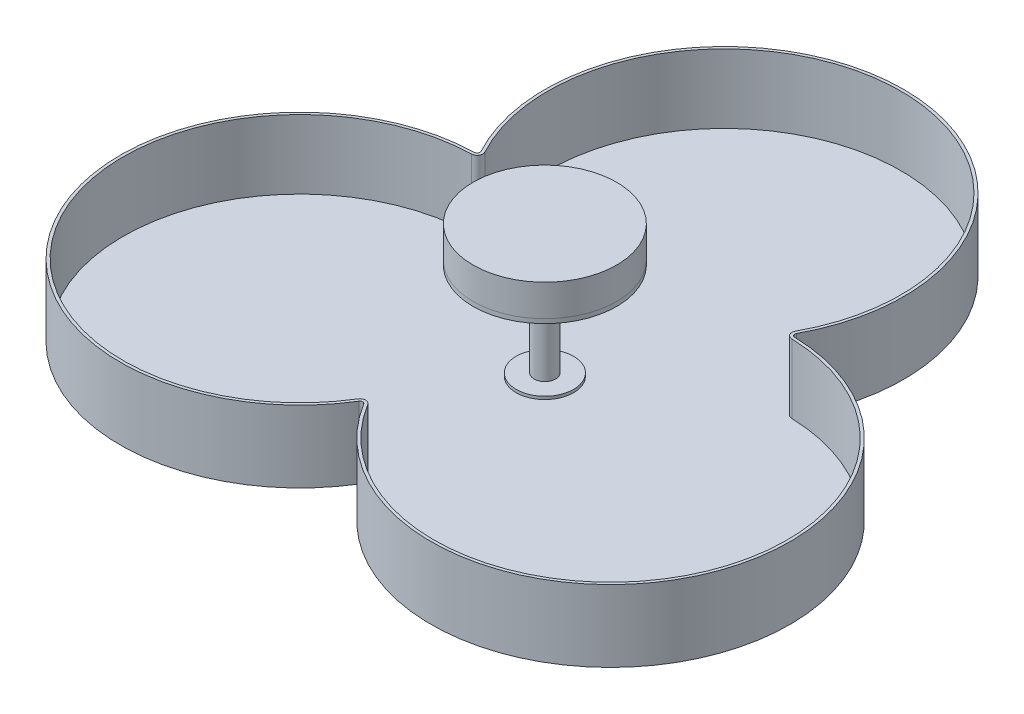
ISO-10303-21;
HEADER;
FILE_DESCRIPTION(('STEP AP214'),'2;1');
FILE_NAME('part.step','',(''),(''),'','','');
FILE_SCHEMA(('AUTOMOTIVE_DESIGN { 1 0 10303 214 1 1 1 1 }'));
ENDSEC;
DATA;
#1=APPLICATION_CONTEXT('core data for automotive mechanical design processes');
#2=APPLICATION_PROTOCOL_DEFINITION('international standard','automotive_design',2000,#1);
#3=PRODUCT_CONTEXT('',#1,'mechanical');
#4=PRODUCT('Part','Part','',(#3));
#5=PRODUCT_RELATED_PRODUCT_CATEGORY('part','',(#4));
#6=PRODUCT_DEFINITION_FORMATION('','',#4);
#7=PRODUCT_DEFINITION_CONTEXT('part definition',#1,'design');
#8=PRODUCT_DEFINITION('design','',#6,#7);
#9=PRODUCT_DEFINITION_SHAPE('','',#8);
#10=(LENGTH_UNIT() NAMED_UNIT(*) SI_UNIT(.MILLI.,.METRE.));
#11=(NAMED_UNIT(*) PLANE_ANGLE_UNIT() SI_UNIT($,.RADIAN.));
#12=(NAMED_UNIT(*) SI_UNIT($,.STERADIAN.) SOLID_ANGLE_UNIT());
#13=UNCERTAINTY_MEASURE_WITH_UNIT(LENGTH_MEASURE(1.E-05),#10,'distance_accuracy_value','');
#14=(GEOMETRIC_REPRESENTATION_CONTEXT(3) GLOBAL_UNCERTAINTY_ASSIGNED_CONTEXT((#13)) GLOBAL_UNIT_ASSIGNED_CONTEXT((#10,
#11,#12)) REPRESENTATION_CONTEXT('',''));
#15=CARTESIAN_POINT('',(0.,0.,0.));
#16=DIRECTION('',(0.,0.,1.));
#17=DIRECTION('',(1.,0.,0.));
#18=AXIS2_PLACEMENT_3D('',#15,#16,#17);
#19=CARTESIAN_POINT('',(0.,135.,0.));
#20=DIRECTION('',(0.,-1.,0.));
#21=DIRECTION('',(0.,0.,-1.));
#22=AXIS2_PLACEMENT_3D('',#19,#20,#21);
#23=CYLINDRICAL_SURFACE('',#22,50.);
#24=CARTESIAN_POINT('',(0.,135.,0.));
#25=DIRECTION('',(0.,1.,0.));
#26=DIRECTION('',(0.,0.,1.));
#27=AXIS2_PLACEMENT_3D('',#24,#25,#26);
#28=CIRCLE('',#27,50.);
#29=CARTESIAN_POINT('',(0.,135.,50.));
#30=VERTEX_POINT('',#29);
#31=EDGE_CURVE('E11',#30,#30,#28,.T.);
#32=ORIENTED_EDGE('',*,*,#31,.F.);
#33=EDGE_LOOP('',(#32));
#34=FACE_BOUND('',#33,.T.);
#35=CARTESIAN_POINT('',(0.,113.,0.));
#36=DIRECTION('',(0.,1.,0.));
#37=DIRECTION('',(0.,0.,1.));
#38=AXIS2_PLACEMENT_3D('',#35,#36,#37);
#39=CIRCLE('',#38,50.);
#40=CARTESIAN_POINT('',(0.,113.,50.));
#41=VERTEX_POINT('',#40);
#42=EDGE_CURVE('E42',#41,#41,#39,.T.);
#43=ORIENTED_EDGE('',*,*,#42,.T.);
#44=EDGE_LOOP('',(#43));
#45=FACE_BOUND('',#44,.T.);
#46=ADVANCED_FACE('F39',(#34,#45),#23,.T.);
#47=CARTESIAN_POINT('',(0.,135.,0.));
#48=DIRECTION('',(0.,1.,0.));
#49=DIRECTION('',(0.,0.,1.));
#50=AXIS2_PLACEMENT_3D('',#47,#48,#49);
#51=PLANE('',#50);
#52=ORIENTED_EDGE('',*,*,#31,.T.);
#53=EDGE_LOOP('',(#52));
#54=FACE_BOUND('',#53,.T.);
#55=ADVANCED_FACE('F54',(#54),#51,.T.);
#56=CARTESIAN_POINT('',(0.,113.,0.));
#57=DIRECTION('',(0.,1.,0.));
#58=DIRECTION('',(0.,0.,1.));
#59=AXIS2_PLACEMENT_3D('',#56,#57,#58);
#60=PLANE('',#59);
#61=ORIENTED_EDGE('',*,*,#42,.F.);
#62=EDGE_LOOP('',(#61));
#63=FACE_BOUND('',#62,.T.);
#64=ADVANCED_FACE('F52',(#63),#60,.F.);
#65=CLOSED_SHELL('',(#46,#55,#64));
#66=MANIFOLD_SOLID_BREP('B2',#65);
#67=CARTESIAN_POINT('',(0.,113.,0.));
#68=DIRECTION('',(0.,-1.,0.));
#69=DIRECTION('',(0.,0.,-1.));
#70=AXIS2_PLACEMENT_3D('',#67,#68,#69);
#71=CYLINDRICAL_SURFACE('',#70,50.);
#72=CARTESIAN_POINT('',(0.,113.,0.));
#73=DIRECTION('',(0.,1.,0.));
#74=DIRECTION('',(0.,0.,1.));
#75=AXIS2_PLACEMENT_3D('',#72,#73,#74);
#76=CIRCLE('',#75,50.);
#77=CARTESIAN_POINT('',(0.,113.,50.));
#78=VERTEX_POINT('',#77);
#79=EDGE_CURVE('E38',#78,#78,#76,.T.);
#80=ORIENTED_EDGE('',*,*,#79,.F.);
#81=EDGE_LOOP('',(#80));
#82=FACE_BOUND('',#81,.T.);
#83=CARTESIAN_POINT('',(0.,110.,0.));
#84=DIRECTION('',(0.,1.,0.));
#85=DIRECTION('',(0.,0.,1.));
#86=AXIS2_PLACEMENT_3D('',#83,#84,#85);
#87=CIRCLE('',#86,50.);
#88=CARTESIAN_POINT('',(0.,110.,50.));
#89=VERTEX_POINT('',#88);
#90=EDGE_CURVE('E90',#89,#89,#87,.T.);
#91=ORIENTED_EDGE('',*,*,#90,.T.);
#92=EDGE_LOOP('',(#91));
#93=FACE_BOUND('',#92,.T.);
#94=ADVANCED_FACE('F87',(#82,#93),#71,.T.);
#95=CARTESIAN_POINT('',(0.,113.,0.));
#96=DIRECTION('',(0.,1.,0.));
#97=DIRECTION('',(0.,0.,1.));
#98=AXIS2_PLACEMENT_3D('',#95,#96,#97);
#99=PLANE('',#98);
#100=ORIENTED_EDGE('',*,*,#79,.T.);
#101=EDGE_LOOP('',(#100));
#102=FACE_BOUND('',#101,.T.);
#103=ADVANCED_FACE('F102',(#102),#99,.T.);
#104=CARTESIAN_POINT('',(0.,110.,0.));
#105=DIRECTION('',(0.,1.,0.));
#106=DIRECTION('',(0.,0.,1.));
#107=AXIS2_PLACEMENT_3D('',#104,#105,#106);
#108=PLANE('',#107);
#109=ORIENTED_EDGE('',*,*,#90,.F.);
#110=EDGE_LOOP('',(#109));
#111=FACE_BOUND('',#110,.T.);
#112=ADVANCED_FACE('F100',(#111),#108,.F.);
#113=CLOSED_SHELL('',(#94,#103,#112));
#114=MANIFOLD_SOLID_BREP('B6',#113);
#115=CARTESIAN_POINT('',(0.,45.,0.));
#116=DIRECTION('',(0.,1.,0.));
#117=DIRECTION('',(0.,0.,1.));
#118=AXIS2_PLACEMENT_3D('',#115,#116,#117);
#119=PLANE('',#118);
#120=CARTESIAN_POINT('',(0.,45.,0.));
#121=DIRECTION('',(0.,1.,0.));
#122=DIRECTION('',(0.,0.,1.));
#123=AXIS2_PLACEMENT_3D('',#120,#121,#122);
#124=CIRCLE('',#123,20.);
#125=CARTESIAN_POINT('',(0.,45.,20.));
#126=VERTEX_POINT('',#125);
#127=EDGE_CURVE('E86',#126,#126,#124,.T.);
#128=ORIENTED_EDGE('',*,*,#127,.T.);
#129=EDGE_LOOP('',(#128));
#130=FACE_BOUND('',#129,.T.);
#131=CARTESIAN_POINT('',(0.,45.,0.));
#132=DIRECTION('',(0.,1.,0.));
#133=DIRECTION('',(0.,0.,1.));
#134=AXIS2_PLACEMENT_3D('',#131,#132,#133);
#135=CIRCLE('',#134,7.5);
#136=CARTESIAN_POINT('',(0.,45.,7.5));
#137=VERTEX_POINT('',#136);
#138=EDGE_CURVE('E148',#137,#137,#135,.T.);
#139=ORIENTED_EDGE('',*,*,#138,.F.);
#140=EDGE_LOOP('',(#139));
#141=FACE_BOUND('',#140,.T.);
#142=ADVANCED_FACE('F137',(#130,#141),#119,.T.);
#143=CARTESIAN_POINT('',(0.,43.,0.));
#144=DIRECTION('',(0.,1.,0.));
#145=DIRECTION('',(0.,0.,1.));
#146=AXIS2_PLACEMENT_3D('',#143,#144,#145);
#147=PLANE('',#146);
#148=CARTESIAN_POINT('',(0.,43.,0.));
#149=DIRECTION('',(0.,1.,0.));
#150=DIRECTION('',(0.,0.,1.));
#151=AXIS2_PLACEMENT_3D('',#148,#149,#150);
#152=CIRCLE('',#151,20.);
#153=CARTESIAN_POINT('',(0.,43.,20.));
#154=VERTEX_POINT('',#153);
#155=EDGE_CURVE('E141',#154,#154,#152,.T.);
#156=ORIENTED_EDGE('',*,*,#155,.F.);
#157=EDGE_LOOP('',(#156));
#158=FACE_BOUND('',#157,.T.);
#159=CARTESIAN_POINT('',(0.,43.,0.));
#160=DIRECTION('',(0.,1.,0.));
#161=DIRECTION('',(0.,0.,1.));
#162=AXIS2_PLACEMENT_3D('',#159,#160,#161);
#163=CIRCLE('',#162,7.5);
#164=CARTESIAN_POINT('',(0.,43.,7.5));
#165=VERTEX_POINT('',#164);
#166=EDGE_CURVE('E150',#165,#165,#163,.T.);
#167=ORIENTED_EDGE('',*,*,#166,.T.);
#168=EDGE_LOOP('',(#167));
#169=FACE_BOUND('',#168,.T.);
#170=ADVANCED_FACE('F160',(#158,#169),#147,.F.);
#171=CARTESIAN_POINT('',(0.,45.,0.));
#172=DIRECTION('',(0.,-1.,0.));
#173=DIRECTION('',(0.,0.,-1.));
#174=AXIS2_PLACEMENT_3D('',#171,#172,#173);
#175=CYLINDRICAL_SURFACE('',#174,20.);
#176=ORIENTED_EDGE('',*,*,#127,.F.);
#177=EDGE_LOOP('',(#176));
#178=FACE_BOUND('',#177,.T.);
#179=ORIENTED_EDGE('',*,*,#155,.T.);
#180=EDGE_LOOP('',(#179));
#181=FACE_BOUND('',#180,.T.);
#182=ADVANCED_FACE('F139',(#178,#181),#175,.T.);
#183=CARTESIAN_POINT('',(0.,45.,0.));
#184=DIRECTION('',(0.,-1.,0.));
#185=DIRECTION('',(0.,0.,-1.));
#186=AXIS2_PLACEMENT_3D('',#183,#184,#185);
#187=CYLINDRICAL_SURFACE('',#186,7.5);
#188=ORIENTED_EDGE('',*,*,#138,.T.);
#189=EDGE_LOOP('',(#188));
#190=FACE_BOUND('',#189,.T.);
#191=ORIENTED_EDGE('',*,*,#166,.F.);
#192=EDGE_LOOP('',(#191));
#193=FACE_BOUND('',#192,.T.);
#194=ADVANCED_FACE('F156',(#190,#193),#187,.F.);
#195=CLOSED_SHELL('',(#142,#170,#182,#194));
#196=MANIFOLD_SOLID_BREP('B33',#195);
#197=CARTESIAN_POINT('',(54.1265877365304,91.,-31.2500000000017));
#198=DIRECTION('',(0.,1.,0.));
#199=DIRECTION('',(0.,0.,1.));
#200=AXIS2_PLACEMENT_3D('',#197,#198,#199);
#201=PLANE('',#200);
#202=CARTESIAN_POINT('',(-108.253175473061,91.,62.5000000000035));
#203=DIRECTION('',(0.,1.,0.));
#204=DIRECTION('',(0.,0.,1.));
#205=AXIS2_PLACEMENT_3D('',#202,#203,#204);
#206=CIRCLE('',#205,125.000000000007);
#207=CARTESIAN_POINT('',(-111.585764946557,91.,-62.4555674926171));
#208=VERTEX_POINT('',#207);
#209=CARTESIAN_POINT('',(-1.70477441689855,91.,127.863890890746));
#210=VERTEX_POINT('',#209);
#211=EDGE_CURVE('E351',#208,#210,#206,.T.);
#212=ORIENTED_EDGE('',*,*,#211,.T.);
#213=CARTESIAN_POINT('',(0.,91.,128.909713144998));
#214=DIRECTION('',(0.,1.,0.));
#215=DIRECTION('',(0.,0.,1.));
#216=AXIS2_PLACEMENT_3D('',#213,#214,#215);
#217=CIRCLE('',#216,2.);
#218=CARTESIAN_POINT('',(1.70477441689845,91.,127.863890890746));
#219=VERTEX_POINT('',#218);
#220=EDGE_CURVE('E376',#210,#219,#217,.F.);
#221=ORIENTED_EDGE('',*,*,#220,.T.);
#222=CARTESIAN_POINT('',(108.253175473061,91.,62.5000000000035));
#223=DIRECTION('',(0.,1.,0.));
#224=DIRECTION('',(0.,0.,1.));
#225=AXIS2_PLACEMENT_3D('',#222,#223,#224);
#226=CIRCLE('',#225,125.000000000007);
#227=CARTESIAN_POINT('',(111.585764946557,91.,-62.4555674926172));
#228=VERTEX_POINT('',#227);
#229=EDGE_CURVE('E345',#219,#228,#226,.T.);
#230=ORIENTED_EDGE('',*,*,#229,.T.);
#231=CARTESIAN_POINT('',(111.639086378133,91.,-64.454856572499));
#232=DIRECTION('',(0.,1.,0.));
#233=DIRECTION('',(0.,0.,1.));
#234=AXIS2_PLACEMENT_3D('',#231,#232,#233);
#235=CIRCLE('',#234,2.);
#236=CARTESIAN_POINT('',(109.880990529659,91.,-65.408323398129));
#237=VERTEX_POINT('',#236);
#238=EDGE_CURVE('E380',#228,#237,#235,.F.);
#239=ORIENTED_EDGE('',*,*,#238,.T.);
#240=CARTESIAN_POINT('',(0.,91.,-125.000000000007));
#241=DIRECTION('',(0.,1.,0.));
#242=DIRECTION('',(0.,0.,1.));
#243=AXIS2_PLACEMENT_3D('',#240,#241,#242);
#244=CIRCLE('',#243,125.000000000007);
#245=CARTESIAN_POINT('',(-109.880990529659,91.,-65.408323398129));
#246=VERTEX_POINT('',#245);
#247=EDGE_CURVE('E348',#237,#246,#244,.T.);
#248=ORIENTED_EDGE('',*,*,#247,.T.);
#249=CARTESIAN_POINT('',(-111.639086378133,91.,-64.4548565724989));
#250=DIRECTION('',(0.,1.,0.));
#251=DIRECTION('',(0.,0.,1.));
#252=AXIS2_PLACEMENT_3D('',#249,#250,#251);
#253=CIRCLE('',#252,2.);
#254=EDGE_CURVE('E135',#246,#208,#253,.F.);
#255=ORIENTED_EDGE('',*,*,#254,.T.);
#256=EDGE_LOOP('',(#212,#221,#230,#239,#248,#255));
#257=FACE_BOUND('',#256,.T.);
#258=CARTESIAN_POINT('',(-108.253175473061,91.,62.5000000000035));
#259=DIRECTION('',(0.,1.,0.));
#260=DIRECTION('',(0.,0.,1.));
#261=AXIS2_PLACEMENT_3D('',#258,#259,#260);
#262=CIRCLE('',#261,123.000000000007);
#263=CARTESIAN_POINT('',(-111.532443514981,91.,-60.4562784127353));
#264=VERTEX_POINT('',#263);
#265=CARTESIAN_POINT('',(-3.40954883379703,91.,126.818068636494));
#266=VERTEX_POINT('',#265);
#267=EDGE_CURVE('E325',#264,#266,#262,.T.);
#268=ORIENTED_EDGE('',*,*,#267,.F.);
#269=CARTESIAN_POINT('',(-111.639086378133,91.,-64.4548565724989));
#270=DIRECTION('',(0.,1.,0.));
#271=DIRECTION('',(0.,0.,1.));
#272=AXIS2_PLACEMENT_3D('',#269,#270,#271);
#273=CIRCLE('',#272,4.);
#274=CARTESIAN_POINT('',(-108.122894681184,91.,-66.361790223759));
#275=VERTEX_POINT('',#274);
#276=EDGE_CURVE('E339',#275,#264,#273,.F.);
#277=ORIENTED_EDGE('',*,*,#276,.F.);
#278=CARTESIAN_POINT('',(0.,91.,-125.000000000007));
#279=DIRECTION('',(0.,1.,0.));
#280=DIRECTION('',(0.,0.,1.));
#281=AXIS2_PLACEMENT_3D('',#278,#279,#280);
#282=CIRCLE('',#281,123.000000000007);
#283=CARTESIAN_POINT('',(108.122894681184,91.,-66.361790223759));
#284=VERTEX_POINT('',#283);
#285=EDGE_CURVE('E222',#284,#275,#282,.T.);
#286=ORIENTED_EDGE('',*,*,#285,.F.);
#287=CARTESIAN_POINT('',(111.639086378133,91.,-64.454856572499));
#288=DIRECTION('',(0.,1.,0.));
#289=DIRECTION('',(0.,0.,1.));
#290=AXIS2_PLACEMENT_3D('',#287,#288,#289);
#291=CIRCLE('',#290,4.);
#292=CARTESIAN_POINT('',(111.532443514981,91.,-60.4562784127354));
#293=VERTEX_POINT('',#292);
#294=EDGE_CURVE('E335',#293,#284,#291,.F.);
#295=ORIENTED_EDGE('',*,*,#294,.F.);
#296=CARTESIAN_POINT('',(108.253175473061,91.,62.5000000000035));
#297=DIRECTION('',(0.,1.,0.));
#298=DIRECTION('',(0.,0.,1.));
#299=AXIS2_PLACEMENT_3D('',#296,#297,#298);
#300=CIRCLE('',#299,123.000000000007);
#301=CARTESIAN_POINT('',(3.40954883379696,91.,126.818068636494));
#302=VERTEX_POINT('',#301);
#303=EDGE_CURVE('E320',#302,#293,#300,.T.);
#304=ORIENTED_EDGE('',*,*,#303,.F.);
#305=CARTESIAN_POINT('',(0.,91.,128.909713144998));
#306=DIRECTION('',(0.,1.,0.));
#307=DIRECTION('',(0.,0.,1.));
#308=AXIS2_PLACEMENT_3D('',#305,#306,#307);
#309=CIRCLE('',#308,4.);
#310=EDGE_CURVE('E309',#266,#302,#309,.F.);
#311=ORIENTED_EDGE('',*,*,#310,.F.);
#312=EDGE_LOOP('',(#268,#277,#286,#295,#304,#311));
#313=FACE_BOUND('',#312,.T.);
#314=ADVANCED_FACE('F206',(#257,#313),#201,.T.);
#315=CARTESIAN_POINT('',(108.253175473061,91.,62.5000000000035));
#316=DIRECTION('',(0.,-1.,0.));
#317=DIRECTION('',(0.,0.,-1.));
#318=AXIS2_PLACEMENT_3D('',#315,#316,#317);
#319=CYLINDRICAL_SURFACE('',#318,125.000000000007);
#320=ORIENTED_EDGE('',*,*,#229,.F.);
#321=DIRECTION('',(0.,-1.,0.));
#322=VECTOR('',#321,1.);
#323=CARTESIAN_POINT('',(1.70477441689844,91.,127.863890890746));
#324=LINE('',#323,#322);
#325=CARTESIAN_POINT('',(1.70477441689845,41.,127.863890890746));
#326=VERTEX_POINT('',#325);
#327=EDGE_CURVE('E362',#219,#326,#324,.T.);
#328=ORIENTED_EDGE('',*,*,#327,.T.);
#329=CARTESIAN_POINT('',(108.253175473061,41.,62.5000000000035));
#330=DIRECTION('',(0.,1.,0.));
#331=DIRECTION('',(0.,0.,1.));
#332=AXIS2_PLACEMENT_3D('',#329,#330,#331);
#333=CIRCLE('',#332,125.000000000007);
#334=CARTESIAN_POINT('',(111.585764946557,41.,-62.4555674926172));
#335=VERTEX_POINT('',#334);
#336=EDGE_CURVE('E341',#326,#335,#333,.T.);
#337=ORIENTED_EDGE('',*,*,#336,.T.);
#338=DIRECTION('',(0.,-1.,0.));
#339=VECTOR('',#338,1.);
#340=CARTESIAN_POINT('',(111.585764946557,91.,-62.4555674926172));
#341=LINE('',#340,#339);
#342=EDGE_CURVE('E354',#335,#228,#341,.F.);
#343=ORIENTED_EDGE('',*,*,#342,.T.);
#344=EDGE_LOOP('',(#320,#328,#337,#343));
#345=FACE_BOUND('',#344,.T.);
#346=ADVANCED_FACE('F405',(#345),#319,.T.);
#347=CARTESIAN_POINT('',(0.,91.,-125.000000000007));
#348=DIRECTION('',(0.,-1.,0.));
#349=DIRECTION('',(0.,0.,-1.));
#350=AXIS2_PLACEMENT_3D('',#347,#348,#349);
#351=CYLINDRICAL_SURFACE('',#350,125.000000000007);
#352=ORIENTED_EDGE('',*,*,#247,.F.);
#353=DIRECTION('',(0.,-1.,0.));
#354=VECTOR('',#353,1.);
#355=CARTESIAN_POINT('',(109.880990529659,91.,-65.408323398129));
#356=LINE('',#355,#354);
#357=CARTESIAN_POINT('',(109.880990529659,41.,-65.408323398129));
#358=VERTEX_POINT('',#357);
#359=EDGE_CURVE('E371',#237,#358,#356,.T.);
#360=ORIENTED_EDGE('',*,*,#359,.T.);
#361=CARTESIAN_POINT('',(0.,41.,-125.000000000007));
#362=DIRECTION('',(0.,1.,0.));
#363=DIRECTION('',(0.,0.,1.));
#364=AXIS2_PLACEMENT_3D('',#361,#362,#363);
#365=CIRCLE('',#364,125.000000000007);
#366=CARTESIAN_POINT('',(-109.880990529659,41.,-65.408323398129));
#367=VERTEX_POINT('',#366);
#368=EDGE_CURVE('E357',#358,#367,#365,.T.);
#369=ORIENTED_EDGE('',*,*,#368,.T.);
#370=DIRECTION('',(0.,-1.,0.));
#371=VECTOR('',#370,1.);
#372=CARTESIAN_POINT('',(-109.880990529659,91.,-65.408323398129));
#373=LINE('',#372,#371);
#374=EDGE_CURVE('E230',#367,#246,#373,.F.);
#375=ORIENTED_EDGE('',*,*,#374,.T.);
#376=EDGE_LOOP('',(#352,#360,#369,#375));
#377=FACE_BOUND('',#376,.T.);
#378=ADVANCED_FACE('F389',(#377),#351,.T.);
#379=CARTESIAN_POINT('',(-108.253175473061,91.,62.5000000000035));
#380=DIRECTION('',(0.,-1.,0.));
#381=DIRECTION('',(0.,0.,-1.));
#382=AXIS2_PLACEMENT_3D('',#379,#380,#381);
#383=CYLINDRICAL_SURFACE('',#382,125.000000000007);
#384=CARTESIAN_POINT('',(-108.253175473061,41.,62.5000000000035));
#385=DIRECTION('',(0.,1.,0.));
#386=DIRECTION('',(0.,0.,1.));
#387=AXIS2_PLACEMENT_3D('',#384,#385,#386);
#388=CIRCLE('',#387,125.000000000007);
#389=CARTESIAN_POINT('',(-111.585764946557,41.,-62.4555674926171));
#390=VERTEX_POINT('',#389);
#391=CARTESIAN_POINT('',(-1.70477441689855,41.,127.863890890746));
#392=VERTEX_POINT('',#391);
#393=EDGE_CURVE('E349',#390,#392,#388,.T.);
#394=ORIENTED_EDGE('',*,*,#393,.T.);
#395=DIRECTION('',(0.,-1.,0.));
#396=VECTOR('',#395,1.);
#397=CARTESIAN_POINT('',(-1.70477441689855,91.,127.863890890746));
#398=LINE('',#397,#396);
#399=EDGE_CURVE('E368',#392,#210,#398,.F.);
#400=ORIENTED_EDGE('',*,*,#399,.T.);
#401=ORIENTED_EDGE('',*,*,#211,.F.);
#402=DIRECTION('',(0.,-1.,0.));
#403=VECTOR('',#402,1.);
#404=CARTESIAN_POINT('',(-111.585764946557,91.,-62.4555674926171));
#405=LINE('',#404,#403);
#406=EDGE_CURVE('E365',#208,#390,#405,.T.);
#407=ORIENTED_EDGE('',*,*,#406,.T.);
#408=EDGE_LOOP('',(#394,#400,#401,#407));
#409=FACE_BOUND('',#408,.T.);
#410=ADVANCED_FACE('F397',(#409),#383,.T.);
#411=CARTESIAN_POINT('',(54.1265877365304,41.,-31.2500000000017));
#412=DIRECTION('',(0.,1.,0.));
#413=DIRECTION('',(0.,0.,1.));
#414=AXIS2_PLACEMENT_3D('',#411,#412,#413);
#415=PLANE('',#414);
#416=CARTESIAN_POINT('',(0.,41.,0.));
#417=DIRECTION('',(0.,1.,0.));
#418=DIRECTION('',(0.,0.,1.));
#419=AXIS2_PLACEMENT_3D('',#416,#417,#418);
#420=CIRCLE('',#419,7.5);
#421=CARTESIAN_POINT('',(0.,41.,-7.5));
#422=VERTEX_POINT('',#421);
#423=EDGE_CURVE('E538',#422,#422,#420,.F.);
#424=ORIENTED_EDGE('',*,*,#423,.F.);
#425=EDGE_LOOP('',(#424));
#426=FACE_BOUND('',#425,.T.);
#427=ORIENTED_EDGE('',*,*,#336,.F.);
#428=CARTESIAN_POINT('',(0.,41.,128.909713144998));
#429=DIRECTION('',(0.,1.,0.));
#430=DIRECTION('',(0.,0.,1.));
#431=AXIS2_PLACEMENT_3D('',#428,#429,#430);
#432=CIRCLE('',#431,2.);
#433=EDGE_CURVE('E374',#326,#392,#432,.T.);
#434=ORIENTED_EDGE('',*,*,#433,.T.);
#435=ORIENTED_EDGE('',*,*,#393,.F.);
#436=CARTESIAN_POINT('',(-111.639086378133,41.,-64.4548565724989));
#437=DIRECTION('',(0.,1.,0.));
#438=DIRECTION('',(0.,0.,1.));
#439=AXIS2_PLACEMENT_3D('',#436,#437,#438);
#440=CIRCLE('',#439,2.);
#441=EDGE_CURVE('E215',#390,#367,#440,.T.);
#442=ORIENTED_EDGE('',*,*,#441,.T.);
#443=ORIENTED_EDGE('',*,*,#368,.F.);
#444=CARTESIAN_POINT('',(111.639086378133,41.,-64.454856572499));
#445=DIRECTION('',(0.,1.,0.));
#446=DIRECTION('',(0.,0.,1.));
#447=AXIS2_PLACEMENT_3D('',#444,#445,#446);
#448=CIRCLE('',#447,2.);
#449=EDGE_CURVE('E378',#358,#335,#448,.T.);
#450=ORIENTED_EDGE('',*,*,#449,.T.);
#451=EDGE_LOOP('',(#427,#434,#435,#442,#443,#450));
#452=FACE_BOUND('',#451,.T.);
#453=ADVANCED_FACE('F386',(#426,#452),#415,.F.);
#454=CARTESIAN_POINT('',(0.,91.,128.909713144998));
#455=DIRECTION('',(0.,1.,0.));
#456=DIRECTION('',(0.,0.,1.));
#457=AXIS2_PLACEMENT_3D('',#454,#455,#456);
#458=CYLINDRICAL_SURFACE('',#457,2.);
#459=ORIENTED_EDGE('',*,*,#220,.F.);
#460=ORIENTED_EDGE('',*,*,#399,.F.);
#461=ORIENTED_EDGE('',*,*,#433,.F.);
#462=ORIENTED_EDGE('',*,*,#327,.F.);
#463=EDGE_LOOP('',(#459,#460,#461,#462));
#464=FACE_BOUND('',#463,.T.);
#465=ADVANCED_FACE('F400',(#464),#458,.F.);
#466=CARTESIAN_POINT('',(111.639086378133,91.,-64.454856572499));
#467=DIRECTION('',(0.,1.,0.));
#468=DIRECTION('',(0.,0.,1.));
#469=AXIS2_PLACEMENT_3D('',#466,#467,#468);
#470=CYLINDRICAL_SURFACE('',#469,2.);
#471=ORIENTED_EDGE('',*,*,#238,.F.);
#472=ORIENTED_EDGE('',*,*,#342,.F.);
#473=ORIENTED_EDGE('',*,*,#449,.F.);
#474=ORIENTED_EDGE('',*,*,#359,.F.);
#475=EDGE_LOOP('',(#471,#472,#473,#474));
#476=FACE_BOUND('',#475,.T.);
#477=ADVANCED_FACE('F408',(#476),#470,.F.);
#478=CARTESIAN_POINT('',(-111.639086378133,91.,-64.4548565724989));
#479=DIRECTION('',(0.,1.,0.));
#480=DIRECTION('',(0.,0.,1.));
#481=AXIS2_PLACEMENT_3D('',#478,#479,#480);
#482=CYLINDRICAL_SURFACE('',#481,2.);
#483=ORIENTED_EDGE('',*,*,#254,.F.);
#484=ORIENTED_EDGE('',*,*,#374,.F.);
#485=ORIENTED_EDGE('',*,*,#441,.F.);
#486=ORIENTED_EDGE('',*,*,#406,.F.);
#487=EDGE_LOOP('',(#483,#484,#485,#486));
#488=FACE_BOUND('',#487,.T.);
#489=ADVANCED_FACE('F208',(#488),#482,.F.);
#490=CARTESIAN_POINT('',(108.253175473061,91.,62.5000000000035));
#491=DIRECTION('',(0.,-1.,0.));
#492=DIRECTION('',(0.,0.,-1.));
#493=AXIS2_PLACEMENT_3D('',#490,#491,#492);
#494=CYLINDRICAL_SURFACE('',#493,123.000000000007);
#495=ORIENTED_EDGE('',*,*,#303,.T.);
#496=DIRECTION('',(0.,-1.,0.));
#497=VECTOR('',#496,1.);
#498=CARTESIAN_POINT('',(111.532443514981,91.,-60.4562784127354));
#499=LINE('',#498,#497);
#500=CARTESIAN_POINT('',(111.532443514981,43.,-60.4562784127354));
#501=VERTEX_POINT('',#500);
#502=EDGE_CURVE('E343',#501,#293,#499,.F.);
#503=ORIENTED_EDGE('',*,*,#502,.F.);
#504=CARTESIAN_POINT('',(108.253175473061,43.,62.5000000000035));
#505=DIRECTION('',(0.,1.,0.));
#506=DIRECTION('',(0.,0.,1.));
#507=AXIS2_PLACEMENT_3D('',#504,#505,#506);
#508=CIRCLE('',#507,123.000000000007);
#509=CARTESIAN_POINT('',(3.40954883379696,43.,126.818068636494));
#510=VERTEX_POINT('',#509);
#511=EDGE_CURVE('E540',#510,#501,#508,.T.);
#512=ORIENTED_EDGE('',*,*,#511,.F.);
#513=DIRECTION('',(0.,-1.,0.));
#514=VECTOR('',#513,1.);
#515=CARTESIAN_POINT('',(3.40954883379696,91.,126.818068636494));
#516=LINE('',#515,#514);
#517=EDGE_CURVE('E305',#302,#510,#516,.T.);
#518=ORIENTED_EDGE('',*,*,#517,.F.);
#519=EDGE_LOOP('',(#495,#503,#512,#518));
#520=FACE_BOUND('',#519,.T.);
#521=ADVANCED_FACE('F414',(#520),#494,.F.);
#522=CARTESIAN_POINT('',(0.,91.,-125.000000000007));
#523=DIRECTION('',(0.,-1.,0.));
#524=DIRECTION('',(0.,0.,-1.));
#525=AXIS2_PLACEMENT_3D('',#522,#523,#524);
#526=CYLINDRICAL_SURFACE('',#525,123.000000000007);
#527=ORIENTED_EDGE('',*,*,#285,.T.);
#528=DIRECTION('',(0.,-1.,0.));
#529=VECTOR('',#528,1.);
#530=CARTESIAN_POINT('',(-108.122894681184,91.,-66.361790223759));
#531=LINE('',#530,#529);
#532=CARTESIAN_POINT('',(-108.122894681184,43.,-66.361790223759));
#533=VERTEX_POINT('',#532);
#534=EDGE_CURVE('E327',#533,#275,#531,.F.);
#535=ORIENTED_EDGE('',*,*,#534,.F.);
#536=CARTESIAN_POINT('',(0.,43.,-125.000000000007));
#537=DIRECTION('',(0.,1.,0.));
#538=DIRECTION('',(0.,0.,1.));
#539=AXIS2_PLACEMENT_3D('',#536,#537,#538);
#540=CIRCLE('',#539,123.000000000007);
#541=CARTESIAN_POINT('',(108.122894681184,43.,-66.361790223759));
#542=VERTEX_POINT('',#541);
#543=EDGE_CURVE('E321',#542,#533,#540,.T.);
#544=ORIENTED_EDGE('',*,*,#543,.F.);
#545=DIRECTION('',(0.,-1.,0.));
#546=VECTOR('',#545,1.);
#547=CARTESIAN_POINT('',(108.122894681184,91.,-66.361790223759));
#548=LINE('',#547,#546);
#549=EDGE_CURVE('E310',#284,#542,#548,.T.);
#550=ORIENTED_EDGE('',*,*,#549,.F.);
#551=EDGE_LOOP('',(#527,#535,#544,#550));
#552=FACE_BOUND('',#551,.T.);
#553=ADVANCED_FACE('F473',(#552),#526,.F.);
#554=CARTESIAN_POINT('',(-108.253175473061,91.,62.5000000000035));
#555=DIRECTION('',(0.,-1.,0.));
#556=DIRECTION('',(0.,0.,-1.));
#557=AXIS2_PLACEMENT_3D('',#554,#555,#556);
#558=CYLINDRICAL_SURFACE('',#557,123.000000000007);
#559=CARTESIAN_POINT('',(-108.253175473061,43.,62.5000000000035));
#560=DIRECTION('',(0.,1.,0.));
#561=DIRECTION('',(0.,0.,1.));
#562=AXIS2_PLACEMENT_3D('',#559,#560,#561);
#563=CIRCLE('',#562,123.000000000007);
#564=CARTESIAN_POINT('',(-111.532443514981,43.,-60.4562784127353));
#565=VERTEX_POINT('',#564);
#566=CARTESIAN_POINT('',(-3.40954883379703,43.,126.818068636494));
#567=VERTEX_POINT('',#566);
#568=EDGE_CURVE('E313',#565,#567,#563,.T.);
#569=ORIENTED_EDGE('',*,*,#568,.F.);
#570=DIRECTION('',(0.,-1.,0.));
#571=VECTOR('',#570,1.);
#572=CARTESIAN_POINT('',(-111.532443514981,91.,-60.4562784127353));
#573=LINE('',#572,#571);
#574=EDGE_CURVE('E328',#264,#565,#573,.T.);
#575=ORIENTED_EDGE('',*,*,#574,.F.);
#576=ORIENTED_EDGE('',*,*,#267,.T.);
#577=DIRECTION('',(0.,-1.,0.));
#578=VECTOR('',#577,1.);
#579=CARTESIAN_POINT('',(-3.40954883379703,91.,126.818068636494));
#580=LINE('',#579,#578);
#581=EDGE_CURVE('E302',#567,#266,#580,.F.);
#582=ORIENTED_EDGE('',*,*,#581,.F.);
#583=EDGE_LOOP('',(#569,#575,#576,#582));
#584=FACE_BOUND('',#583,.T.);
#585=ADVANCED_FACE('F323',(#584),#558,.F.);
#586=CARTESIAN_POINT('',(54.1265877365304,43.,-31.2500000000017));
#587=DIRECTION('',(0.,1.,0.));
#588=DIRECTION('',(0.,0.,1.));
#589=AXIS2_PLACEMENT_3D('',#586,#587,#588);
#590=PLANE('',#589);
#591=CARTESIAN_POINT('',(0.,43.,0.));
#592=DIRECTION('',(0.,1.,0.));
#593=DIRECTION('',(0.,0.,1.));
#594=AXIS2_PLACEMENT_3D('',#591,#592,#593);
#595=CIRCLE('',#594,7.5);
#596=CARTESIAN_POINT('',(0.,43.,-7.5));
#597=VERTEX_POINT('',#596);
#598=EDGE_CURVE('E210',#597,#597,#595,.F.);
#599=ORIENTED_EDGE('',*,*,#598,.T.);
#600=EDGE_LOOP('',(#599));
#601=FACE_BOUND('',#600,.T.);
#602=ORIENTED_EDGE('',*,*,#511,.T.);
#603=CARTESIAN_POINT('',(111.639086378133,43.,-64.454856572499));
#604=DIRECTION('',(0.,1.,0.));
#605=DIRECTION('',(0.,0.,1.));
#606=AXIS2_PLACEMENT_3D('',#603,#604,#605);
#607=CIRCLE('',#606,4.);
#608=EDGE_CURVE('E337',#542,#501,#607,.T.);
#609=ORIENTED_EDGE('',*,*,#608,.F.);
#610=ORIENTED_EDGE('',*,*,#543,.T.);
#611=CARTESIAN_POINT('',(-111.639086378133,43.,-64.4548565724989));
#612=DIRECTION('',(0.,1.,0.));
#613=DIRECTION('',(0.,0.,1.));
#614=AXIS2_PLACEMENT_3D('',#611,#612,#613);
#615=CIRCLE('',#614,4.);
#616=EDGE_CURVE('E316',#565,#533,#615,.T.);
#617=ORIENTED_EDGE('',*,*,#616,.F.);
#618=ORIENTED_EDGE('',*,*,#568,.T.);
#619=CARTESIAN_POINT('',(0.,43.,128.909713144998));
#620=DIRECTION('',(0.,1.,0.));
#621=DIRECTION('',(0.,0.,1.));
#622=AXIS2_PLACEMENT_3D('',#619,#620,#621);
#623=CIRCLE('',#622,4.);
#624=EDGE_CURVE('E298',#510,#567,#623,.T.);
#625=ORIENTED_EDGE('',*,*,#624,.F.);
#626=EDGE_LOOP('',(#602,#609,#610,#617,#618,#625));
#627=FACE_BOUND('',#626,.T.);
#628=ADVANCED_FACE('F314',(#601,#627),#590,.T.);
#629=CARTESIAN_POINT('',(0.,91.,128.909713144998));
#630=DIRECTION('',(0.,1.,0.));
#631=DIRECTION('',(0.,0.,1.));
#632=AXIS2_PLACEMENT_3D('',#629,#630,#631);
#633=CYLINDRICAL_SURFACE('',#632,4.);
#634=ORIENTED_EDGE('',*,*,#310,.T.);
#635=ORIENTED_EDGE('',*,*,#517,.T.);
#636=ORIENTED_EDGE('',*,*,#624,.T.);
#637=ORIENTED_EDGE('',*,*,#581,.T.);
#638=EDGE_LOOP('',(#634,#635,#636,#637));
#639=FACE_BOUND('',#638,.T.);
#640=ADVANCED_FACE('F300',(#639),#633,.T.);
#641=CARTESIAN_POINT('',(111.639086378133,91.,-64.454856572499));
#642=DIRECTION('',(0.,1.,0.));
#643=DIRECTION('',(0.,0.,1.));
#644=AXIS2_PLACEMENT_3D('',#641,#642,#643);
#645=CYLINDRICAL_SURFACE('',#644,4.);
#646=ORIENTED_EDGE('',*,*,#294,.T.);
#647=ORIENTED_EDGE('',*,*,#549,.T.);
#648=ORIENTED_EDGE('',*,*,#608,.T.);
#649=ORIENTED_EDGE('',*,*,#502,.T.);
#650=EDGE_LOOP('',(#646,#647,#648,#649));
#651=FACE_BOUND('',#650,.T.);
#652=ADVANCED_FACE('F501',(#651),#645,.T.);
#653=CARTESIAN_POINT('',(-111.639086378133,91.,-64.4548565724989));
#654=DIRECTION('',(0.,1.,0.));
#655=DIRECTION('',(0.,0.,1.));
#656=AXIS2_PLACEMENT_3D('',#653,#654,#655);
#657=CYLINDRICAL_SURFACE('',#656,4.);
#658=ORIENTED_EDGE('',*,*,#276,.T.);
#659=ORIENTED_EDGE('',*,*,#574,.T.);
#660=ORIENTED_EDGE('',*,*,#616,.T.);
#661=ORIENTED_EDGE('',*,*,#534,.T.);
#662=EDGE_LOOP('',(#658,#659,#660,#661));
#663=FACE_BOUND('',#662,.T.);
#664=ADVANCED_FACE('F424',(#663),#657,.T.);
#665=CARTESIAN_POINT('',(0.,143.,0.));
#666=DIRECTION('',(0.,-1.,0.));
#667=DIRECTION('',(0.,0.,-1.));
#668=AXIS2_PLACEMENT_3D('',#665,#666,#667);
#669=CYLINDRICAL_SURFACE('',#668,7.5);
#670=CARTESIAN_POINT('',(0.,43.,-7.5));
#671=CARTESIAN_POINT('',(0.,42.9791666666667,-7.5));
#672=CARTESIAN_POINT('',(0.,42.9583333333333,-7.5));
#673=CARTESIAN_POINT('',(0.,42.9166666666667,-7.5));
#674=CARTESIAN_POINT('',(0.,42.8958333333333,-7.5));
#675=CARTESIAN_POINT('',(0.,42.8541666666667,-7.5));
#676=CARTESIAN_POINT('',(0.,42.8333333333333,-7.5));
#677=CARTESIAN_POINT('',(0.,42.7916666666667,-7.5));
#678=CARTESIAN_POINT('',(0.,42.7708333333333,-7.5));
#679=CARTESIAN_POINT('',(0.,42.7291666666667,-7.5));
#680=CARTESIAN_POINT('',(0.,42.7083333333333,-7.5));
#681=CARTESIAN_POINT('',(0.,42.6666666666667,-7.5));
#682=CARTESIAN_POINT('',(0.,42.6458333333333,-7.5));
#683=CARTESIAN_POINT('',(0.,42.6041666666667,-7.5));
#684=CARTESIAN_POINT('',(0.,42.5833333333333,-7.5));
#685=CARTESIAN_POINT('',(0.,42.5416666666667,-7.5));
#686=CARTESIAN_POINT('',(0.,42.5208333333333,-7.5));
#687=CARTESIAN_POINT('',(0.,42.4791666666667,-7.5));
#688=CARTESIAN_POINT('',(0.,42.4583333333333,-7.5));
#689=CARTESIAN_POINT('',(0.,42.4166666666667,-7.5));
#690=CARTESIAN_POINT('',(0.,42.3958333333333,-7.5));
#691=CARTESIAN_POINT('',(0.,42.3541666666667,-7.5));
#692=CARTESIAN_POINT('',(0.,42.3333333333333,-7.5));
#693=CARTESIAN_POINT('',(0.,42.2916666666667,-7.5));
#694=CARTESIAN_POINT('',(0.,42.2708333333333,-7.5));
#695=CARTESIAN_POINT('',(0.,42.2291666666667,-7.5));
#696=CARTESIAN_POINT('',(0.,42.2083333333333,-7.5));
#697=CARTESIAN_POINT('',(0.,42.1666666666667,-7.5));
#698=CARTESIAN_POINT('',(0.,42.1458333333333,-7.5));
#699=CARTESIAN_POINT('',(0.,42.1041666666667,-7.5));
#700=CARTESIAN_POINT('',(0.,42.0833333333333,-7.5));
#701=CARTESIAN_POINT('',(0.,42.0416666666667,-7.5));
#702=CARTESIAN_POINT('',(0.,42.0208333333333,-7.5));
#703=CARTESIAN_POINT('',(0.,41.9791666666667,-7.5));
#704=CARTESIAN_POINT('',(0.,41.9583333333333,-7.5));
#705=CARTESIAN_POINT('',(0.,41.9166666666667,-7.5));
#706=CARTESIAN_POINT('',(0.,41.8958333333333,-7.5));
#707=CARTESIAN_POINT('',(0.,41.8541666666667,-7.5));
#708=CARTESIAN_POINT('',(0.,41.8333333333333,-7.5));
#709=CARTESIAN_POINT('',(0.,41.7916666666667,-7.5));
#710=CARTESIAN_POINT('',(0.,41.7708333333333,-7.5));
#711=CARTESIAN_POINT('',(0.,41.7291666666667,-7.5));
#712=CARTESIAN_POINT('',(0.,41.7083333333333,-7.5));
#713=CARTESIAN_POINT('',(0.,41.6666666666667,-7.5));
#714=CARTESIAN_POINT('',(0.,41.6458333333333,-7.5));
#715=CARTESIAN_POINT('',(0.,41.6041666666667,-7.5));
#716=CARTESIAN_POINT('',(0.,41.5833333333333,-7.5));
#717=CARTESIAN_POINT('',(0.,41.5416666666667,-7.5));
#718=CARTESIAN_POINT('',(0.,41.5208333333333,-7.5));
#719=CARTESIAN_POINT('',(0.,41.4791666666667,-7.5));
#720=CARTESIAN_POINT('',(0.,41.4583333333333,-7.5));
#721=CARTESIAN_POINT('',(0.,41.4166666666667,-7.5));
#722=CARTESIAN_POINT('',(0.,41.3958333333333,-7.5));
#723=CARTESIAN_POINT('',(0.,41.3541666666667,-7.5));
#724=CARTESIAN_POINT('',(0.,41.3333333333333,-7.5));
#725=CARTESIAN_POINT('',(0.,41.2916666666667,-7.5));
#726=CARTESIAN_POINT('',(0.,41.2708333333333,-7.5));
#727=CARTESIAN_POINT('',(0.,41.2291666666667,-7.5));
#728=CARTESIAN_POINT('',(0.,41.2083333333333,-7.5));
#729=CARTESIAN_POINT('',(0.,41.1666666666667,-7.5));
#730=CARTESIAN_POINT('',(0.,41.1458333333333,-7.5));
#731=CARTESIAN_POINT('',(0.,41.1041666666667,-7.5));
#732=CARTESIAN_POINT('',(0.,41.0833333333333,-7.5));
#733=CARTESIAN_POINT('',(0.,41.0416666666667,-7.5));
#734=CARTESIAN_POINT('',(0.,41.0208333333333,-7.5));
#735=CARTESIAN_POINT('',(0.,41.,-7.5));
#736=B_SPLINE_CURVE_WITH_KNOTS('',3,(#670,#671,#672,#673,#674,#675,#676,#677,#678,#679,#680,
#681,#682,#683,#684,#685,#686,#687,#688,#689,#690,#691,#692,#693,#694,#695,#696,#697,#698,#699,
#700,#701,#702,#703,#704,#705,#706,#707,#708,#709,#710,#711,#712,#713,#714,#715,#716,#717,#718,
#719,#720,#721,#722,#723,#724,#725,#726,#727,#728,#729,#730,#731,#732,#733,#734,#735),
.UNSPECIFIED.,.F.,.F.,(4,2,2,2,2,2,2,2,2,2,2,2,2,2,2,2,2,2,2,2,2,2,2,2,2,2,2,2,2,2,2,2,4),(0.,
0.0624999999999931,0.125,0.187500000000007,0.25,0.312499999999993,0.375,0.437500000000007,0.5,
0.562499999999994,0.625000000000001,0.687500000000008,0.750000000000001,0.812499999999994,
0.875000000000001,0.937500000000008,1.,1.06249999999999,1.125,1.18750000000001,1.25,
1.31249999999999,1.375,1.43750000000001,1.5,1.56249999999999,1.625,1.68750000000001,1.75,
1.81249999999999,1.875,1.93750000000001,2.),.UNSPECIFIED.);
#737=EDGE_CURVE('BSEAM516',#597,#422,#736,.T.);
#738=ORIENTED_EDGE('',*,*,#598,.F.);
#739=ORIENTED_EDGE('',*,*,#423,.T.);
#740=ORIENTED_EDGE('',*,*,#737,.T.);
#741=ORIENTED_EDGE('',*,*,#737,.F.);
#742=EDGE_LOOP('',(#738,#740,#739,#741));
#743=FACE_BOUND('',#742,.T.);
#744=ADVANCED_FACE('F516',(#743),#669,.F.);
#745=CLOSED_SHELL('',(#314,#346,#378,#410,#453,#465,#477,#489,#521,#553,#585,#628,#640,#652,
#664,#744));
#746=MANIFOLD_SOLID_BREP('B81',#745);
#747=CARTESIAN_POINT('',(0.,41.,0.));
#748=DIRECTION('',(0.,1.,0.));
#749=DIRECTION('',(0.,0.,1.));
#750=AXIS2_PLACEMENT_3D('',#747,#748,#749);
#751=PLANE('',#750);
#752=CARTESIAN_POINT('',(0.,41.,0.));
#753=DIRECTION('',(0.,1.,0.));
#754=DIRECTION('',(0.,0.,1.));
#755=AXIS2_PLACEMENT_3D('',#752,#753,#754);
#756=CIRCLE('',#755,20.);
#757=CARTESIAN_POINT('',(0.,41.,20.));
#758=VERTEX_POINT('',#757);
#759=EDGE_CURVE('E205',#758,#758,#756,.T.);
#760=ORIENTED_EDGE('',*,*,#759,.T.);
#761=EDGE_LOOP('',(#760));
#762=FACE_BOUND('',#761,.T.);
#763=CARTESIAN_POINT('',(0.,41.,0.));
#764=DIRECTION('',(0.,1.,0.));
#765=DIRECTION('',(0.,0.,1.));
#766=AXIS2_PLACEMENT_3D('',#763,#764,#765);
#767=CIRCLE('',#766,7.5);
#768=CARTESIAN_POINT('',(0.,41.,7.5));
#769=VERTEX_POINT('',#768);
#770=EDGE_CURVE('E587',#769,#769,#767,.T.);
#771=ORIENTED_EDGE('',*,*,#770,.F.);
#772=EDGE_LOOP('',(#771));
#773=FACE_BOUND('',#772,.T.);
#774=ADVANCED_FACE('F576',(#762,#773),#751,.T.);
#775=CARTESIAN_POINT('',(0.,39.,0.));
#776=DIRECTION('',(0.,1.,0.));
#777=DIRECTION('',(0.,0.,1.));
#778=AXIS2_PLACEMENT_3D('',#775,#776,#777);
#779=PLANE('',#778);
#780=CARTESIAN_POINT('',(0.,39.,0.));
#781=DIRECTION('',(0.,1.,0.));
#782=DIRECTION('',(0.,0.,1.));
#783=AXIS2_PLACEMENT_3D('',#780,#781,#782);
#784=CIRCLE('',#783,20.);
#785=CARTESIAN_POINT('',(0.,39.,20.));
#786=VERTEX_POINT('',#785);
#787=EDGE_CURVE('E580',#786,#786,#784,.T.);
#788=ORIENTED_EDGE('',*,*,#787,.F.);
#789=EDGE_LOOP('',(#788));
#790=FACE_BOUND('',#789,.T.);
#791=CARTESIAN_POINT('',(0.,39.,0.));
#792=DIRECTION('',(0.,1.,0.));
#793=DIRECTION('',(0.,0.,1.));
#794=AXIS2_PLACEMENT_3D('',#791,#792,#793);
#795=CIRCLE('',#794,7.5);
#796=CARTESIAN_POINT('',(0.,39.,7.5));
#797=VERTEX_POINT('',#796);
#798=EDGE_CURVE('E589',#797,#797,#795,.T.);
#799=ORIENTED_EDGE('',*,*,#798,.T.);
#800=EDGE_LOOP('',(#799));
#801=FACE_BOUND('',#800,.T.);
#802=ADVANCED_FACE('F599',(#790,#801),#779,.F.);
#803=CARTESIAN_POINT('',(0.,41.,0.));
#804=DIRECTION('',(0.,-1.,0.));
#805=DIRECTION('',(0.,0.,-1.));
#806=AXIS2_PLACEMENT_3D('',#803,#804,#805);
#807=CYLINDRICAL_SURFACE('',#806,20.);
#808=ORIENTED_EDGE('',*,*,#759,.F.);
#809=EDGE_LOOP('',(#808));
#810=FACE_BOUND('',#809,.T.);
#811=ORIENTED_EDGE('',*,*,#787,.T.);
#812=EDGE_LOOP('',(#811));
#813=FACE_BOUND('',#812,.T.);
#814=ADVANCED_FACE('F578',(#810,#813),#807,.T.);
#815=CARTESIAN_POINT('',(0.,41.,0.));
#816=DIRECTION('',(0.,-1.,0.));
#817=DIRECTION('',(0.,0.,-1.));
#818=AXIS2_PLACEMENT_3D('',#815,#816,#817);
#819=CYLINDRICAL_SURFACE('',#818,7.5);
#820=ORIENTED_EDGE('',*,*,#770,.T.);
#821=EDGE_LOOP('',(#820));
#822=FACE_BOUND('',#821,.T.);
#823=ORIENTED_EDGE('',*,*,#798,.F.);
#824=EDGE_LOOP('',(#823));
#825=FACE_BOUND('',#824,.T.);
#826=ADVANCED_FACE('F595',(#822,#825),#819,.F.);
#827=CLOSED_SHELL('',(#774,#802,#814,#826));
#828=MANIFOLD_SOLID_BREP('B129',#827);
#829=CARTESIAN_POINT('',(0.,40.,0.));
#830=DIRECTION('',(0.,-1.,0.));
#831=DIRECTION('',(0.,0.,-1.));
#832=AXIS2_PLACEMENT_3D('',#829,#830,#831);
#833=CYLINDRICAL_SURFACE('',#832,50.);
#834=CARTESIAN_POINT('',(0.,40.,0.));
#835=DIRECTION('',(0.,1.,0.));
#836=DIRECTION('',(0.,0.,1.));
#837=AXIS2_PLACEMENT_3D('',#834,#835,#836);
#838=CIRCLE('',#837,50.);
#839=CARTESIAN_POINT('',(0.,40.,50.));
#840=VERTEX_POINT('',#839);
#841=EDGE_CURVE('E644',#840,#840,#838,.T.);
#842=ORIENTED_EDGE('',*,*,#841,.F.);
#843=EDGE_LOOP('',(#842));
#844=FACE_BOUND('',#843,.T.);
#845=CARTESIAN_POINT('',(0.,0.,0.));
#846=DIRECTION('',(0.,1.,0.));
#847=DIRECTION('',(0.,0.,1.));
#848=AXIS2_PLACEMENT_3D('',#845,#846,#847);
#849=CIRCLE('',#848,50.);
#850=CARTESIAN_POINT('',(0.,0.,50.));
#851=VERTEX_POINT('',#850);
#852=EDGE_CURVE('E640',#851,#851,#849,.T.);
#853=ORIENTED_EDGE('',*,*,#852,.T.);
#854=EDGE_LOOP('',(#853));
#855=FACE_BOUND('',#854,.T.);
#856=ADVANCED_FACE('F637',(#844,#855),#833,.T.);
#857=CARTESIAN_POINT('',(0.,40.,0.));
#858=DIRECTION('',(0.,1.,0.));
#859=DIRECTION('',(0.,0.,1.));
#860=AXIS2_PLACEMENT_3D('',#857,#858,#859);
#861=PLANE('',#860);
#862=CARTESIAN_POINT('',(0.,40.,0.));
#863=DIRECTION('',(0.,1.,0.));
#864=DIRECTION('',(0.,0.,1.));
#865=AXIS2_PLACEMENT_3D('',#862,#863,#864);
#866=CIRCLE('',#865,7.5);
#867=CARTESIAN_POINT('',(0.,40.,7.5));
#868=VERTEX_POINT('',#867);
#869=EDGE_CURVE('E575',#868,#868,#866,.T.);
#870=ORIENTED_EDGE('',*,*,#869,.F.);
#871=EDGE_LOOP('',(#870));
#872=FACE_BOUND('',#871,.T.);
#873=ORIENTED_EDGE('',*,*,#841,.T.);
#874=EDGE_LOOP('',(#873));
#875=FACE_BOUND('',#874,.T.);
#876=ADVANCED_FACE('F683',(#872,#875),#861,.T.);
#877=CARTESIAN_POINT('',(0.,0.,0.));
#878=DIRECTION('',(0.,1.,0.));
#879=DIRECTION('',(0.,0.,1.));
#880=AXIS2_PLACEMENT_3D('',#877,#878,#879);
#881=PLANE('',#880);
#882=CARTESIAN_POINT('',(0.,0.,0.));
#883=DIRECTION('',(0.,1.,0.));
#884=DIRECTION('',(0.,0.,1.));
#885=AXIS2_PLACEMENT_3D('',#882,#883,#884);
#886=CIRCLE('',#885,48.);
#887=CARTESIAN_POINT('',(0.,0.,48.));
#888=VERTEX_POINT('',#887);
#889=EDGE_CURVE('E657',#888,#888,#886,.T.);
#890=ORIENTED_EDGE('',*,*,#889,.T.);
#891=EDGE_LOOP('',(#890));
#892=FACE_BOUND('',#891,.T.);
#893=ORIENTED_EDGE('',*,*,#852,.F.);
#894=EDGE_LOOP('',(#893));
#895=FACE_BOUND('',#894,.T.);
#896=ADVANCED_FACE('F688',(#892,#895),#881,.F.);
#897=CARTESIAN_POINT('',(0.,110.,0.));
#898=DIRECTION('',(0.,-1.,0.));
#899=DIRECTION('',(0.,0.,-1.));
#900=AXIS2_PLACEMENT_3D('',#897,#898,#899);
#901=CYLINDRICAL_SURFACE('',#900,7.5);
#902=CARTESIAN_POINT('',(0.,110.,0.));
#903=DIRECTION('',(0.,1.,0.));
#904=DIRECTION('',(0.,0.,1.));
#905=AXIS2_PLACEMENT_3D('',#902,#903,#904);
#906=CIRCLE('',#905,7.5);
#907=CARTESIAN_POINT('',(0.,110.,7.5));
#908=VERTEX_POINT('',#907);
#909=EDGE_CURVE('E650',#908,#908,#906,.T.);
#910=ORIENTED_EDGE('',*,*,#909,.F.);
#911=EDGE_LOOP('',(#910));
#912=FACE_BOUND('',#911,.T.);
#913=ORIENTED_EDGE('',*,*,#869,.T.);
#914=EDGE_LOOP('',(#913));
#915=FACE_BOUND('',#914,.T.);
#916=ADVANCED_FACE('F697',(#912,#915),#901,.T.);
#917=CARTESIAN_POINT('',(0.,110.,0.));
#918=DIRECTION('',(0.,1.,0.));
#919=DIRECTION('',(0.,0.,1.));
#920=AXIS2_PLACEMENT_3D('',#917,#918,#919);
#921=PLANE('',#920);
#922=CARTESIAN_POINT('',(0.,110.,0.));
#923=DIRECTION('',(0.,1.,0.));
#924=DIRECTION('',(0.,0.,1.));
#925=AXIS2_PLACEMENT_3D('',#922,#923,#924);
#926=CIRCLE('',#925,5.5);
#927=CARTESIAN_POINT('',(0.,110.,5.5));
#928=VERTEX_POINT('',#927);
#929=EDGE_CURVE('E654',#928,#928,#926,.T.);
#930=ORIENTED_EDGE('',*,*,#929,.F.);
#931=EDGE_LOOP('',(#930));
#932=FACE_BOUND('',#931,.T.);
#933=ORIENTED_EDGE('',*,*,#909,.T.);
#934=EDGE_LOOP('',(#933));
#935=FACE_BOUND('',#934,.T.);
#936=ADVANCED_FACE('F680',(#932,#935),#921,.T.);
#937=CARTESIAN_POINT('',(0.,40.,0.));
#938=DIRECTION('',(0.,-1.,0.));
#939=DIRECTION('',(0.,0.,-1.));
#940=AXIS2_PLACEMENT_3D('',#937,#938,#939);
#941=CYLINDRICAL_SURFACE('',#940,48.);
#942=CARTESIAN_POINT('',(0.,38.,0.));
#943=DIRECTION('',(0.,1.,0.));
#944=DIRECTION('',(0.,0.,1.));
#945=AXIS2_PLACEMENT_3D('',#942,#943,#944);
#946=CIRCLE('',#945,48.);
#947=CARTESIAN_POINT('',(0.,38.,48.));
#948=VERTEX_POINT('',#947);
#949=EDGE_CURVE('E660',#948,#948,#946,.T.);
#950=ORIENTED_EDGE('',*,*,#949,.T.);
#951=EDGE_LOOP('',(#950));
#952=FACE_BOUND('',#951,.T.);
#953=ORIENTED_EDGE('',*,*,#889,.F.);
#954=EDGE_LOOP('',(#953));
#955=FACE_BOUND('',#954,.T.);
#956=ADVANCED_FACE('F666',(#952,#955),#941,.F.);
#957=CARTESIAN_POINT('',(0.,38.,0.));
#958=DIRECTION('',(0.,1.,0.));
#959=DIRECTION('',(0.,0.,1.));
#960=AXIS2_PLACEMENT_3D('',#957,#958,#959);
#961=PLANE('',#960);
#962=CARTESIAN_POINT('',(0.,38.,0.));
#963=DIRECTION('',(0.,1.,0.));
#964=DIRECTION('',(0.,0.,1.));
#965=AXIS2_PLACEMENT_3D('',#962,#963,#964);
#966=CIRCLE('',#965,5.5);
#967=CARTESIAN_POINT('',(0.,38.,5.5));
#968=VERTEX_POINT('',#967);
#969=EDGE_CURVE('E653',#968,#968,#966,.T.);
#970=ORIENTED_EDGE('',*,*,#969,.T.);
#971=EDGE_LOOP('',(#970));
#972=FACE_BOUND('',#971,.T.);
#973=ORIENTED_EDGE('',*,*,#949,.F.);
#974=EDGE_LOOP('',(#973));
#975=FACE_BOUND('',#974,.T.);
#976=ADVANCED_FACE('F669',(#972,#975),#961,.F.);
#977=CARTESIAN_POINT('',(0.,110.,0.));
#978=DIRECTION('',(0.,-1.,0.));
#979=DIRECTION('',(0.,0.,-1.));
#980=AXIS2_PLACEMENT_3D('',#977,#978,#979);
#981=CYLINDRICAL_SURFACE('',#980,5.5);
#982=ORIENTED_EDGE('',*,*,#929,.T.);
#983=EDGE_LOOP('',(#982));
#984=FACE_BOUND('',#983,.T.);
#985=ORIENTED_EDGE('',*,*,#969,.F.);
#986=EDGE_LOOP('',(#985));
#987=FACE_BOUND('',#986,.T.);
#988=ADVANCED_FACE('F671',(#984,#987),#981,.F.);
#989=CLOSED_SHELL('',(#856,#876,#896,#916,#936,#956,#976,#988));
#990=MANIFOLD_SOLID_BREP('B200',#989);
#991=ADVANCED_BREP_SHAPE_REPRESENTATION('',(#18,#66,#114,#196,#746,#828,#990),#14);
#992=SHAPE_DEFINITION_REPRESENTATION(#9,#991);
ENDSEC;
END-ISO-10303-21;
